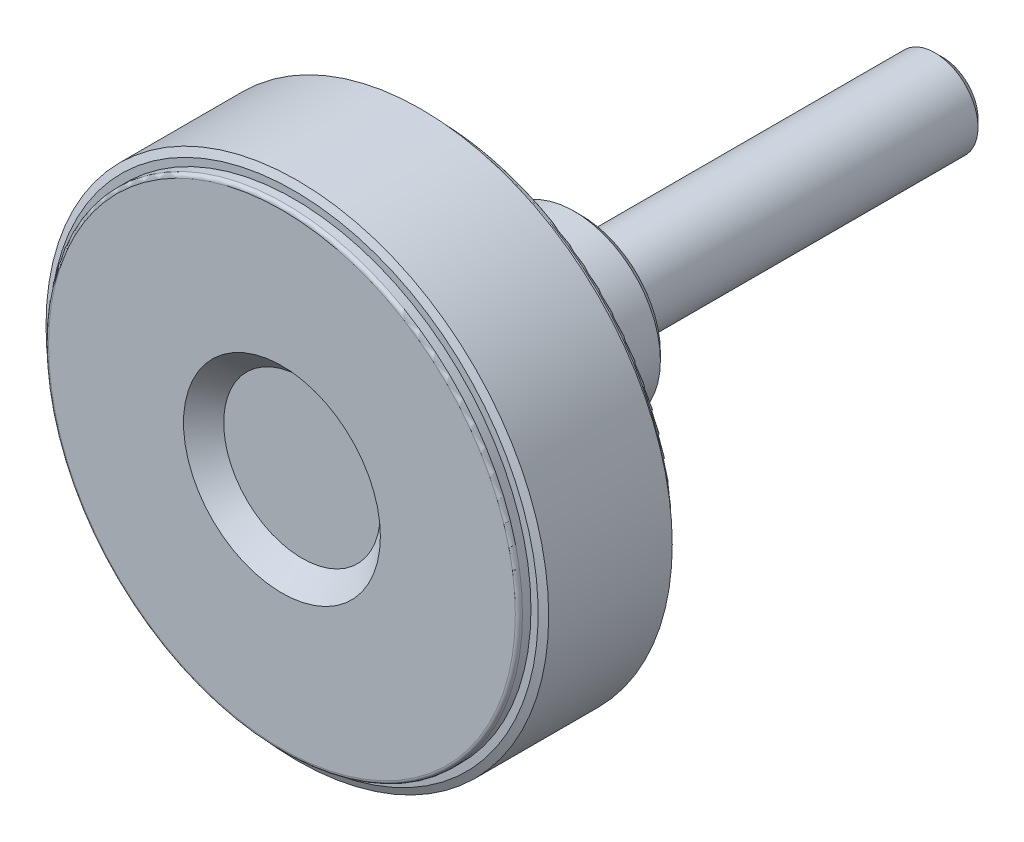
ISO-10303-21;
HEADER;
FILE_DESCRIPTION(('STEP AP214'),'2;1');
FILE_NAME('part.step','',(''),(''),'','','');
FILE_SCHEMA(('AUTOMOTIVE_DESIGN { 1 0 10303 214 1 1 1 1 }'));
ENDSEC;
DATA;
#1=APPLICATION_CONTEXT('core data for automotive mechanical design processes');
#2=APPLICATION_PROTOCOL_DEFINITION('international standard','automotive_design',2000,#1);
#3=PRODUCT_CONTEXT('',#1,'mechanical');
#4=PRODUCT('Part','Part','',(#3));
#5=PRODUCT_RELATED_PRODUCT_CATEGORY('part','',(#4));
#6=PRODUCT_DEFINITION_FORMATION('','',#4);
#7=PRODUCT_DEFINITION_CONTEXT('part definition',#1,'design');
#8=PRODUCT_DEFINITION('design','',#6,#7);
#9=PRODUCT_DEFINITION_SHAPE('','',#8);
#10=(LENGTH_UNIT() NAMED_UNIT(*) SI_UNIT(.MILLI.,.METRE.));
#11=(NAMED_UNIT(*) PLANE_ANGLE_UNIT() SI_UNIT($,.RADIAN.));
#12=(NAMED_UNIT(*) SI_UNIT($,.STERADIAN.) SOLID_ANGLE_UNIT());
#13=UNCERTAINTY_MEASURE_WITH_UNIT(LENGTH_MEASURE(1.E-05),#10,'distance_accuracy_value','');
#14=(GEOMETRIC_REPRESENTATION_CONTEXT(3) GLOBAL_UNCERTAINTY_ASSIGNED_CONTEXT((#13)) GLOBAL_UNIT_ASSIGNED_CONTEXT((#10,
#11,#12)) REPRESENTATION_CONTEXT('',''));
#15=CARTESIAN_POINT('',(0.,0.,0.));
#16=DIRECTION('',(0.,0.,1.));
#17=DIRECTION('',(1.,0.,0.));
#18=AXIS2_PLACEMENT_3D('',#15,#16,#17);
#19=CARTESIAN_POINT('',(0.,2.46325,-50.));
#20=DIRECTION('',(0.,0.,-1.));
#21=DIRECTION('',(-1.,0.,0.));
#22=AXIS2_PLACEMENT_3D('',#19,#20,#21);
#23=PLANE('',#22);
#24=CARTESIAN_POINT('',(0.,0.,-49.9999999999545));
#25=DIRECTION('',(0.,0.,1.));
#26=DIRECTION('',(1.,0.,0.));
#27=AXIS2_PLACEMENT_3D('',#24,#25,#26);
#28=CIRCLE('',#27,4.92649999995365);
#29=CARTESIAN_POINT('',(4.92649999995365,0.,-49.9999999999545));
#30=VERTEX_POINT('',#29);
#31=EDGE_CURVE('E179',#30,#30,#28,.T.);
#32=ORIENTED_EDGE('',*,*,#31,.F.);
#33=EDGE_LOOP('',(#32));
#34=FACE_BOUND('',#33,.T.);
#35=ADVANCED_FACE('F14',(#34),#23,.T.);
#36=CARTESIAN_POINT('',(0.,0.,-48.9264999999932));
#37=DIRECTION('',(0.,0.,1.));
#38=DIRECTION('',(1.,0.,0.));
#39=AXIS2_PLACEMENT_3D('',#36,#37,#38);
#40=CONICAL_SURFACE('',#39,5.99999999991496,0.785398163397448);
#41=ORIENTED_EDGE('',*,*,#31,.T.);
#42=EDGE_LOOP('',(#41));
#43=FACE_BOUND('',#42,.T.);
#44=CARTESIAN_POINT('',(0.,0.,-48.9265));
#45=DIRECTION('',(0.,0.,1.));
#46=DIRECTION('',(1.,0.,0.));
#47=AXIS2_PLACEMENT_3D('',#44,#45,#46);
#48=CIRCLE('',#47,6.);
#49=CARTESIAN_POINT('',(6.,0.,-48.9265));
#50=VERTEX_POINT('',#49);
#51=EDGE_CURVE('E176',#50,#50,#48,.T.);
#52=ORIENTED_EDGE('',*,*,#51,.F.);
#53=EDGE_LOOP('',(#52));
#54=FACE_BOUND('',#53,.T.);
#55=ADVANCED_FACE('F536',(#43,#54),#40,.T.);
#56=CARTESIAN_POINT('',(0.,0.,-23.96325));
#57=DIRECTION('',(0.,0.,1.));
#58=DIRECTION('',(1.,0.,0.));
#59=AXIS2_PLACEMENT_3D('',#56,#57,#58);
#60=CYLINDRICAL_SURFACE('',#59,6.);
#61=ORIENTED_EDGE('',*,*,#51,.T.);
#62=EDGE_LOOP('',(#61));
#63=FACE_BOUND('',#62,.T.);
#64=CARTESIAN_POINT('',(0.,0.,0.));
#65=DIRECTION('',(0.,0.,1.));
#66=DIRECTION('',(1.,0.,0.));
#67=AXIS2_PLACEMENT_3D('',#64,#65,#66);
#68=CIRCLE('',#67,6.);
#69=CARTESIAN_POINT('',(6.,0.,0.));
#70=VERTEX_POINT('',#69);
#71=EDGE_CURVE('E178',#70,#70,#68,.T.);
#72=ORIENTED_EDGE('',*,*,#71,.F.);
#73=EDGE_LOOP('',(#72));
#74=FACE_BOUND('',#73,.T.);
#75=ADVANCED_FACE('F526',(#63,#74),#60,.T.);
#76=CARTESIAN_POINT('',(0.,4.,0.));
#77=DIRECTION('',(0.,0.,-1.));
#78=DIRECTION('',(-1.,0.,0.));
#79=AXIS2_PLACEMENT_3D('',#76,#77,#78);
#80=PLANE('',#79);
#81=CARTESIAN_POINT('',(0.,0.,0.));
#82=DIRECTION('',(0.,0.,1.));
#83=DIRECTION('',(1.,0.,0.));
#84=AXIS2_PLACEMENT_3D('',#81,#82,#83);
#85=CIRCLE('',#84,8.);
#86=CARTESIAN_POINT('',(8.,0.,0.));
#87=VERTEX_POINT('',#86);
#88=EDGE_CURVE('E211',#87,#87,#85,.T.);
#89=ORIENTED_EDGE('',*,*,#88,.F.);
#90=EDGE_LOOP('',(#89));
#91=FACE_BOUND('',#90,.T.);
#92=ORIENTED_EDGE('',*,*,#71,.T.);
#93=EDGE_LOOP('',(#92));
#94=FACE_BOUND('',#93,.T.);
#95=ADVANCED_FACE('F516',(#91,#94),#80,.T.);
#96=CARTESIAN_POINT('',(0.,0.,0.15));
#97=DIRECTION('',(0.,0.,1.));
#98=DIRECTION('',(1.,0.,0.));
#99=AXIS2_PLACEMENT_3D('',#96,#97,#98);
#100=CYLINDRICAL_SURFACE('',#99,8.);
#101=ORIENTED_EDGE('',*,*,#88,.T.);
#102=EDGE_LOOP('',(#101));
#103=FACE_BOUND('',#102,.T.);
#104=CARTESIAN_POINT('',(0.,0.,0.3));
#105=DIRECTION('',(0.,0.,1.));
#106=DIRECTION('',(1.,0.,0.));
#107=AXIS2_PLACEMENT_3D('',#104,#105,#106);
#108=CIRCLE('',#107,8.);
#109=CARTESIAN_POINT('',(8.,0.,0.3));
#110=VERTEX_POINT('',#109);
#111=EDGE_CURVE('E208',#110,#110,#108,.T.);
#112=ORIENTED_EDGE('',*,*,#111,.F.);
#113=EDGE_LOOP('',(#112));
#114=FACE_BOUND('',#113,.T.);
#115=ADVANCED_FACE('F506',(#103,#114),#100,.T.);
#116=CARTESIAN_POINT('',(0.,9.5,0.3));
#117=DIRECTION('',(0.,0.,-1.));
#118=DIRECTION('',(-1.,0.,0.));
#119=AXIS2_PLACEMENT_3D('',#116,#117,#118);
#120=PLANE('',#119);
#121=CARTESIAN_POINT('',(0.,0.,0.3));
#122=DIRECTION('',(0.,0.,1.));
#123=DIRECTION('',(1.,0.,0.));
#124=AXIS2_PLACEMENT_3D('',#121,#122,#123);
#125=CIRCLE('',#124,11.);
#126=CARTESIAN_POINT('',(11.,0.,0.3));
#127=VERTEX_POINT('',#126);
#128=EDGE_CURVE('E175',#127,#127,#125,.T.);
#129=ORIENTED_EDGE('',*,*,#128,.F.);
#130=EDGE_LOOP('',(#129));
#131=FACE_BOUND('',#130,.T.);
#132=ORIENTED_EDGE('',*,*,#111,.T.);
#133=EDGE_LOOP('',(#132));
#134=FACE_BOUND('',#133,.T.);
#135=ADVANCED_FACE('F496',(#131,#134),#120,.T.);
#136=CARTESIAN_POINT('',(0.,0.,1.3));
#137=DIRECTION('',(0.,0.,1.));
#138=DIRECTION('',(1.,0.,0.));
#139=AXIS2_PLACEMENT_3D('',#136,#137,#138);
#140=CONICAL_SURFACE('',#139,12.,0.785398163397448);
#141=ORIENTED_EDGE('',*,*,#128,.T.);
#142=EDGE_LOOP('',(#141));
#143=FACE_BOUND('',#142,.T.);
#144=CARTESIAN_POINT('',(0.,0.,1.3));
#145=DIRECTION('',(0.,0.,1.));
#146=DIRECTION('',(1.,0.,0.));
#147=AXIS2_PLACEMENT_3D('',#144,#145,#146);
#148=CIRCLE('',#147,12.);
#149=CARTESIAN_POINT('',(12.,0.,1.3));
#150=VERTEX_POINT('',#149);
#151=EDGE_CURVE('E172',#150,#150,#148,.T.);
#152=ORIENTED_EDGE('',*,*,#151,.F.);
#153=EDGE_LOOP('',(#152));
#154=FACE_BOUND('',#153,.T.);
#155=ADVANCED_FACE('F487',(#143,#154),#140,.T.);
#156=CARTESIAN_POINT('',(0.,0.,17.65));
#157=DIRECTION('',(0.,0.,1.));
#158=DIRECTION('',(1.,0.,0.));
#159=AXIS2_PLACEMENT_3D('',#156,#157,#158);
#160=CYLINDRICAL_SURFACE('',#159,12.);
#161=ORIENTED_EDGE('',*,*,#151,.T.);
#162=EDGE_LOOP('',(#161));
#163=FACE_BOUND('',#162,.T.);
#164=CARTESIAN_POINT('',(0.,0.,34.));
#165=DIRECTION('',(0.,0.,-1.));
#166=DIRECTION('',(-1.,0.,0.));
#167=AXIS2_PLACEMENT_3D('',#164,#165,#166);
#168=CIRCLE('',#167,12.);
#169=CARTESIAN_POINT('',(-12.,0.,34.));
#170=VERTEX_POINT('',#169);
#171=EDGE_CURVE('E75',#170,#170,#168,.T.);
#172=ORIENTED_EDGE('',*,*,#171,.T.);
#173=EDGE_LOOP('',(#172));
#174=FACE_BOUND('',#173,.T.);
#175=ADVANCED_FACE('F482',(#163,#174),#160,.T.);
#176=CARTESIAN_POINT('',(0.,0.,34.));
#177=DIRECTION('',(0.,0.,-1.));
#178=DIRECTION('',(-1.,0.,0.));
#179=AXIS2_PLACEMENT_3D('',#176,#177,#178);
#180=TOROIDAL_SURFACE('',#179,13.,1.);
#181=CARTESIAN_POINT('',(0.,0.,35.));
#182=DIRECTION('',(0.,0.,-1.));
#183=DIRECTION('',(1.,0.,0.));
#184=AXIS2_PLACEMENT_3D('',#181,#182,#183);
#185=CIRCLE('',#184,13.);
#186=CARTESIAN_POINT('',(-13.,0.,35.));
#187=VERTEX_POINT('',#186);
#188=CARTESIAN_POINT('',(13.,0.,35.));
#189=VERTEX_POINT('',#188);
#190=EDGE_CURVE('E68',#187,#189,#185,.F.);
#191=ORIENTED_EDGE('',*,*,#190,.F.);
#192=CARTESIAN_POINT('',(0.,0.,35.));
#193=DIRECTION('',(0.,0.,-1.));
#194=DIRECTION('',(-1.,0.,0.));
#195=AXIS2_PLACEMENT_3D('',#192,#193,#194);
#196=CIRCLE('',#195,13.);
#197=CARTESIAN_POINT('',(0.,13.,35.));
#198=VERTEX_POINT('',#197);
#199=EDGE_CURVE('E71',#198,#187,#196,.F.);
#200=ORIENTED_EDGE('',*,*,#199,.F.);
#201=CARTESIAN_POINT('',(0.,0.,35.));
#202=DIRECTION('',(0.,0.,-1.));
#203=DIRECTION('',(0.,1.,0.));
#204=AXIS2_PLACEMENT_3D('',#201,#202,#203);
#205=CIRCLE('',#204,13.);
#206=EDGE_CURVE('E63',#189,#198,#205,.F.);
#207=ORIENTED_EDGE('',*,*,#206,.F.);
#208=EDGE_LOOP('',(#191,#200,#207));
#209=FACE_BOUND('',#208,.T.);
#210=ORIENTED_EDGE('',*,*,#171,.F.);
#211=EDGE_LOOP('',(#210));
#212=FACE_BOUND('',#211,.T.);
#213=ADVANCED_FACE('F66',(#209,#212),#180,.F.);
#214=CARTESIAN_POINT('',(0.,19.4615384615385,35.));
#215=DIRECTION('',(0.,0.,-1.));
#216=DIRECTION('',(-1.,0.,0.));
#217=AXIS2_PLACEMENT_3D('',#214,#215,#216);
#218=PLANE('',#217);
#219=CARTESIAN_POINT('',(0.,0.,35.));
#220=DIRECTION('',(0.,0.,1.));
#221=DIRECTION('',(-1.,0.,0.));
#222=AXIS2_PLACEMENT_3D('',#219,#220,#221);
#223=CIRCLE('',#222,25.9230769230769);
#224=CARTESIAN_POINT('',(25.9230769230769,0.,35.));
#225=VERTEX_POINT('',#224);
#226=CARTESIAN_POINT('',(-25.9230769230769,0.,35.));
#227=VERTEX_POINT('',#226);
#228=EDGE_CURVE('E81',#225,#227,#223,.F.);
#229=ORIENTED_EDGE('',*,*,#228,.T.);
#230=CARTESIAN_POINT('',(0.,0.,35.));
#231=DIRECTION('',(0.,0.,1.));
#232=DIRECTION('',(0.,1.,0.));
#233=AXIS2_PLACEMENT_3D('',#230,#231,#232);
#234=CIRCLE('',#233,25.9230769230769);
#235=CARTESIAN_POINT('',(0.,25.9230769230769,35.));
#236=VERTEX_POINT('',#235);
#237=EDGE_CURVE('E130',#227,#236,#234,.F.);
#238=ORIENTED_EDGE('',*,*,#237,.T.);
#239=CARTESIAN_POINT('',(0.,0.,35.));
#240=DIRECTION('',(0.,0.,1.));
#241=DIRECTION('',(1.,0.,0.));
#242=AXIS2_PLACEMENT_3D('',#239,#240,#241);
#243=CIRCLE('',#242,25.9230769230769);
#244=EDGE_CURVE('E143',#236,#225,#243,.F.);
#245=ORIENTED_EDGE('',*,*,#244,.T.);
#246=EDGE_LOOP('',(#229,#238,#245));
#247=FACE_BOUND('',#246,.T.);
#248=ORIENTED_EDGE('',*,*,#199,.T.);
#249=ORIENTED_EDGE('',*,*,#190,.T.);
#250=ORIENTED_EDGE('',*,*,#206,.T.);
#251=EDGE_LOOP('',(#248,#249,#250));
#252=FACE_BOUND('',#251,.T.);
#253=ADVANCED_FACE('F79',(#247,#252),#218,.T.);
#254=CARTESIAN_POINT('',(0.,0.,34.));
#255=DIRECTION('',(0.,0.,-1.));
#256=DIRECTION('',(-1.,0.,0.));
#257=AXIS2_PLACEMENT_3D('',#254,#255,#256);
#258=TOROIDAL_SURFACE('',#257,25.9230769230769,1.);
#259=ORIENTED_EDGE('',*,*,#237,.F.);
#260=ORIENTED_EDGE('',*,*,#228,.F.);
#261=ORIENTED_EDGE('',*,*,#244,.F.);
#262=EDGE_LOOP('',(#259,#260,#261));
#263=FACE_BOUND('',#262,.T.);
#264=CARTESIAN_POINT('',(0.,0.,34.));
#265=DIRECTION('',(0.,0.,1.));
#266=DIRECTION('',(1.,0.,0.));
#267=AXIS2_PLACEMENT_3D('',#264,#265,#266);
#268=CIRCLE('',#267,26.9230769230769);
#269=CARTESIAN_POINT('',(26.9230769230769,0.,34.));
#270=VERTEX_POINT('',#269);
#271=EDGE_CURVE('E205',#270,#270,#268,.F.);
#272=ORIENTED_EDGE('',*,*,#271,.T.);
#273=EDGE_LOOP('',(#272));
#274=FACE_BOUND('',#273,.T.);
#275=ADVANCED_FACE('F100',(#263,#274),#258,.F.);
#276=CARTESIAN_POINT('',(0.,0.,27.25));
#277=DIRECTION('',(0.,0.,1.));
#278=DIRECTION('',(1.,0.,0.));
#279=AXIS2_PLACEMENT_3D('',#276,#277,#278);
#280=CYLINDRICAL_SURFACE('',#279,26.9230769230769);
#281=ORIENTED_EDGE('',*,*,#271,.F.);
#282=EDGE_LOOP('',(#281));
#283=FACE_BOUND('',#282,.T.);
#284=CARTESIAN_POINT('',(0.,0.,20.5));
#285=DIRECTION('',(0.,0.,1.));
#286=DIRECTION('',(1.,0.,0.));
#287=AXIS2_PLACEMENT_3D('',#284,#285,#286);
#288=CIRCLE('',#287,26.9230769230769);
#289=CARTESIAN_POINT('',(26.9230769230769,0.,20.5));
#290=VERTEX_POINT('',#289);
#291=EDGE_CURVE('E201',#290,#290,#288,.T.);
#292=ORIENTED_EDGE('',*,*,#291,.F.);
#293=EDGE_LOOP('',(#292));
#294=FACE_BOUND('',#293,.T.);
#295=ADVANCED_FACE('F329',(#283,#294),#280,.F.);
#296=CARTESIAN_POINT('',(0.,29.7115384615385,20.5));
#297=DIRECTION('',(0.,0.,-1.));
#298=DIRECTION('',(-1.,0.,0.));
#299=AXIS2_PLACEMENT_3D('',#296,#297,#298);
#300=PLANE('',#299);
#301=CARTESIAN_POINT('',(0.,0.,20.5));
#302=DIRECTION('',(0.,0.,1.));
#303=DIRECTION('',(-1.,0.,0.));
#304=AXIS2_PLACEMENT_3D('',#301,#302,#303);
#305=CIRCLE('',#304,32.5);
#306=CARTESIAN_POINT('',(-32.5,0.,20.5));
#307=VERTEX_POINT('',#306);
#308=CARTESIAN_POINT('',(32.5,0.,20.5));
#309=VERTEX_POINT('',#308);
#310=EDGE_CURVE('E264',#307,#309,#305,.T.);
#311=ORIENTED_EDGE('',*,*,#310,.F.);
#312=CARTESIAN_POINT('',(0.,0.,20.5));
#313=DIRECTION('',(0.,0.,1.));
#314=DIRECTION('',(0.,1.,0.));
#315=AXIS2_PLACEMENT_3D('',#312,#313,#314);
#316=CIRCLE('',#315,32.5);
#317=CARTESIAN_POINT('',(0.,32.5,20.5));
#318=VERTEX_POINT('',#317);
#319=EDGE_CURVE('E299',#318,#307,#316,.T.);
#320=ORIENTED_EDGE('',*,*,#319,.F.);
#321=CARTESIAN_POINT('',(0.,0.,20.5));
#322=DIRECTION('',(0.,0.,1.));
#323=DIRECTION('',(1.,0.,0.));
#324=AXIS2_PLACEMENT_3D('',#321,#322,#323);
#325=CIRCLE('',#324,32.5);
#326=EDGE_CURVE('E204',#309,#318,#325,.T.);
#327=ORIENTED_EDGE('',*,*,#326,.F.);
#328=EDGE_LOOP('',(#311,#320,#327));
#329=FACE_BOUND('',#328,.T.);
#330=ORIENTED_EDGE('',*,*,#291,.T.);
#331=EDGE_LOOP('',(#330));
#332=FACE_BOUND('',#331,.T.);
#333=ADVANCED_FACE('F275',(#329,#332),#300,.T.);
#334=CARTESIAN_POINT('',(0.,0.,21.));
#335=DIRECTION('',(0.,0.,-1.));
#336=DIRECTION('',(-1.,0.,0.));
#337=AXIS2_PLACEMENT_3D('',#334,#335,#336);
#338=TOROIDAL_SURFACE('',#337,32.5,0.5);
#339=ORIENTED_EDGE('',*,*,#319,.T.);
#340=ORIENTED_EDGE('',*,*,#310,.T.);
#341=ORIENTED_EDGE('',*,*,#326,.T.);
#342=EDGE_LOOP('',(#339,#340,#341));
#343=FACE_BOUND('',#342,.T.);
#344=CARTESIAN_POINT('',(0.,0.,21.));
#345=DIRECTION('',(0.,0.,1.));
#346=DIRECTION('',(1.,0.,0.));
#347=AXIS2_PLACEMENT_3D('',#344,#345,#346);
#348=CIRCLE('',#347,33.);
#349=CARTESIAN_POINT('',(33.,0.,21.));
#350=VERTEX_POINT('',#349);
#351=EDGE_CURVE('E200',#350,#350,#348,.T.);
#352=ORIENTED_EDGE('',*,*,#351,.F.);
#353=EDGE_LOOP('',(#352));
#354=FACE_BOUND('',#353,.T.);
#355=ADVANCED_FACE('F269',(#343,#354),#338,.T.);
#356=CARTESIAN_POINT('',(0.,0.,21.59));
#357=DIRECTION('',(0.,0.,1.));
#358=DIRECTION('',(1.,0.,0.));
#359=AXIS2_PLACEMENT_3D('',#356,#357,#358);
#360=CYLINDRICAL_SURFACE('',#359,33.);
#361=ORIENTED_EDGE('',*,*,#351,.T.);
#362=EDGE_LOOP('',(#361));
#363=FACE_BOUND('',#362,.T.);
#364=CARTESIAN_POINT('',(0.,0.,22.18));
#365=DIRECTION('',(0.,0.,1.));
#366=DIRECTION('',(1.,0.,0.));
#367=AXIS2_PLACEMENT_3D('',#364,#365,#366);
#368=CIRCLE('',#367,33.);
#369=CARTESIAN_POINT('',(33.,0.,22.18));
#370=VERTEX_POINT('',#369);
#371=EDGE_CURVE('E197',#370,#370,#368,.T.);
#372=ORIENTED_EDGE('',*,*,#371,.F.);
#373=EDGE_LOOP('',(#372));
#374=FACE_BOUND('',#373,.T.);
#375=ADVANCED_FACE('F274',(#363,#374),#360,.T.);
#376=CARTESIAN_POINT('',(0.,33.5,22.18));
#377=DIRECTION('',(0.,0.,-1.));
#378=DIRECTION('',(-1.,0.,0.));
#379=AXIS2_PLACEMENT_3D('',#376,#377,#378);
#380=PLANE('',#379);
#381=CARTESIAN_POINT('',(0.,0.,22.18));
#382=DIRECTION('',(0.,0.,1.));
#383=DIRECTION('',(1.,0.,0.));
#384=AXIS2_PLACEMENT_3D('',#381,#382,#383);
#385=CIRCLE('',#384,34.);
#386=CARTESIAN_POINT('',(34.,0.,22.18));
#387=VERTEX_POINT('',#386);
#388=EDGE_CURVE('E193',#387,#387,#385,.T.);
#389=ORIENTED_EDGE('',*,*,#388,.F.);
#390=EDGE_LOOP('',(#389));
#391=FACE_BOUND('',#390,.T.);
#392=ORIENTED_EDGE('',*,*,#371,.T.);
#393=EDGE_LOOP('',(#392));
#394=FACE_BOUND('',#393,.T.);
#395=ADVANCED_FACE('F342',(#391,#394),#380,.T.);
#396=CARTESIAN_POINT('',(0.,0.,22.646307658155));
#397=DIRECTION('',(0.,0.,1.));
#398=DIRECTION('',(1.,0.,0.));
#399=AXIS2_PLACEMENT_3D('',#396,#397,#398);
#400=CONICAL_SURFACE('',#399,35.,1.13446401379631);
#401=CARTESIAN_POINT('',(0.,2.67164068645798E-12,22.646307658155));
#402=DIRECTION('',(0.,0.,-1.));
#403=DIRECTION('',(-1.,0.,0.));
#404=AXIS2_PLACEMENT_3D('',#401,#402,#403);
#405=CIRCLE('',#404,34.9999999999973);
#406=CARTESIAN_POINT('',(-34.9999999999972,2.67164068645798E-12,22.646307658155));
#407=VERTEX_POINT('',#406);
#408=EDGE_CURVE('E196',#407,#407,#405,.F.);
#409=ORIENTED_EDGE('',*,*,#408,.F.);
#410=EDGE_LOOP('',(#409));
#411=FACE_BOUND('',#410,.T.);
#412=ORIENTED_EDGE('',*,*,#388,.T.);
#413=EDGE_LOOP('',(#412));
#414=FACE_BOUND('',#413,.T.);
#415=ADVANCED_FACE('F340',(#411,#414),#400,.T.);
#416=CARTESIAN_POINT('',(0.,5.45454545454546,39.2));
#417=DIRECTION('',(0.,0.,1.));
#418=DIRECTION('',(1.,0.,0.));
#419=AXIS2_PLACEMENT_3D('',#416,#417,#418);
#420=PLANE('',#419);
#421=CARTESIAN_POINT('',(0.,0.,39.2));
#422=DIRECTION('',(0.,0.,1.));
#423=DIRECTION('',(1.,0.,0.));
#424=AXIS2_PLACEMENT_3D('',#421,#422,#423);
#425=CIRCLE('',#424,10.9090909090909);
#426=CARTESIAN_POINT('',(10.9090909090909,0.,39.2));
#427=VERTEX_POINT('',#426);
#428=EDGE_CURVE('E181',#427,#427,#425,.T.);
#429=ORIENTED_EDGE('',*,*,#428,.T.);
#430=EDGE_LOOP('',(#429));
#431=FACE_BOUND('',#430,.T.);
#432=ADVANCED_FACE('F242',(#431),#420,.T.);
#433=CARTESIAN_POINT('',(0.,0.,42.));
#434=DIRECTION('',(0.,0.,1.));
#435=DIRECTION('',(1.,0.,0.));
#436=AXIS2_PLACEMENT_3D('',#433,#434,#435);
#437=CONICAL_SURFACE('',#436,13.7090909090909,0.785398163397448);
#438=CARTESIAN_POINT('',(0.,0.,42.));
#439=DIRECTION('',(0.,0.,1.));
#440=DIRECTION('',(1.,0.,0.));
#441=AXIS2_PLACEMENT_3D('',#438,#439,#440);
#442=CIRCLE('',#441,13.7090909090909);
#443=CARTESIAN_POINT('',(13.7090909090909,0.,42.));
#444=VERTEX_POINT('',#443);
#445=EDGE_CURVE('E9',#444,#444,#442,.F.);
#446=ORIENTED_EDGE('',*,*,#445,.F.);
#447=EDGE_LOOP('',(#446));
#448=FACE_BOUND('',#447,.T.);
#449=ORIENTED_EDGE('',*,*,#428,.F.);
#450=EDGE_LOOP('',(#449));
#451=FACE_BOUND('',#450,.T.);
#452=ADVANCED_FACE('F240',(#448,#451),#437,.F.);
#453=CARTESIAN_POINT('',(0.,23.1045454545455,42.));
#454=DIRECTION('',(0.,0.,1.));
#455=DIRECTION('',(1.,0.,0.));
#456=AXIS2_PLACEMENT_3D('',#453,#454,#455);
#457=PLANE('',#456);
#458=ORIENTED_EDGE('',*,*,#445,.T.);
#459=EDGE_LOOP('',(#458));
#460=FACE_BOUND('',#459,.T.);
#461=CARTESIAN_POINT('',(0.,0.,42.));
#462=DIRECTION('',(0.,0.,-1.));
#463=DIRECTION('',(-1.,0.,0.));
#464=AXIS2_PLACEMENT_3D('',#461,#462,#463);
#465=CIRCLE('',#464,32.5);
#466=CARTESIAN_POINT('',(0.,32.5,42.));
#467=VERTEX_POINT('',#466);
#468=CARTESIAN_POINT('',(-32.5,0.,42.));
#469=VERTEX_POINT('',#468);
#470=EDGE_CURVE('E219',#467,#469,#465,.F.);
#471=ORIENTED_EDGE('',*,*,#470,.T.);
#472=CARTESIAN_POINT('',(0.,0.,42.));
#473=DIRECTION('',(0.,0.,-1.));
#474=DIRECTION('',(1.,0.,0.));
#475=AXIS2_PLACEMENT_3D('',#472,#473,#474);
#476=CIRCLE('',#475,32.5);
#477=CARTESIAN_POINT('',(32.5,0.,42.));
#478=VERTEX_POINT('',#477);
#479=EDGE_CURVE('E23',#469,#478,#476,.F.);
#480=ORIENTED_EDGE('',*,*,#479,.T.);
#481=CARTESIAN_POINT('',(0.,0.,42.));
#482=DIRECTION('',(0.,0.,-1.));
#483=DIRECTION('',(0.,1.,0.));
#484=AXIS2_PLACEMENT_3D('',#481,#482,#483);
#485=CIRCLE('',#484,32.5);
#486=EDGE_CURVE('E184',#478,#467,#485,.F.);
#487=ORIENTED_EDGE('',*,*,#486,.T.);
#488=EDGE_LOOP('',(#471,#480,#487));
#489=FACE_BOUND('',#488,.T.);
#490=ADVANCED_FACE('F238',(#460,#489),#457,.T.);
#491=CARTESIAN_POINT('',(0.,0.,41.5));
#492=DIRECTION('',(0.,0.,-1.));
#493=DIRECTION('',(-1.,0.,0.));
#494=AXIS2_PLACEMENT_3D('',#491,#492,#493);
#495=TOROIDAL_SURFACE('',#494,32.5,0.499999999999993);
#496=CARTESIAN_POINT('',(0.,0.,41.5));
#497=DIRECTION('',(0.,0.,-1.));
#498=DIRECTION('',(-1.,0.,0.));
#499=AXIS2_PLACEMENT_3D('',#496,#497,#498);
#500=CIRCLE('',#499,33.);
#501=CARTESIAN_POINT('',(-33.,0.,41.5));
#502=VERTEX_POINT('',#501);
#503=EDGE_CURVE('E185',#502,#502,#500,.F.);
#504=ORIENTED_EDGE('',*,*,#503,.T.);
#505=EDGE_LOOP('',(#504));
#506=FACE_BOUND('',#505,.T.);
#507=ORIENTED_EDGE('',*,*,#479,.F.);
#508=ORIENTED_EDGE('',*,*,#470,.F.);
#509=ORIENTED_EDGE('',*,*,#486,.F.);
#510=EDGE_LOOP('',(#507,#508,#509));
#511=FACE_BOUND('',#510,.T.);
#512=ADVANCED_FACE('F226',(#506,#511),#495,.T.);
#513=CARTESIAN_POINT('',(0.,0.,40.91));
#514=DIRECTION('',(0.,0.,1.));
#515=DIRECTION('',(1.,0.,0.));
#516=AXIS2_PLACEMENT_3D('',#513,#514,#515);
#517=CYLINDRICAL_SURFACE('',#516,33.);
#518=ORIENTED_EDGE('',*,*,#503,.F.);
#519=EDGE_LOOP('',(#518));
#520=FACE_BOUND('',#519,.T.);
#521=CARTESIAN_POINT('',(0.,0.,40.32));
#522=DIRECTION('',(0.,0.,1.));
#523=DIRECTION('',(1.,0.,0.));
#524=AXIS2_PLACEMENT_3D('',#521,#522,#523);
#525=CIRCLE('',#524,33.);
#526=CARTESIAN_POINT('',(33.,0.,40.32));
#527=VERTEX_POINT('',#526);
#528=EDGE_CURVE('E186',#527,#527,#525,.T.);
#529=ORIENTED_EDGE('',*,*,#528,.T.);
#530=EDGE_LOOP('',(#529));
#531=FACE_BOUND('',#530,.T.);
#532=ADVANCED_FACE('F237',(#520,#531),#517,.T.);
#533=CARTESIAN_POINT('',(0.,0.,39.853692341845));
#534=DIRECTION('',(0.,0.,-1.));
#535=DIRECTION('',(-1.,0.,0.));
#536=AXIS2_PLACEMENT_3D('',#533,#534,#535);
#537=CONICAL_SURFACE('',#536,35.,1.13446401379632);
#538=CARTESIAN_POINT('',(0.,0.,40.32));
#539=DIRECTION('',(0.,0.,-1.));
#540=DIRECTION('',(-1.,0.,0.));
#541=AXIS2_PLACEMENT_3D('',#538,#539,#540);
#542=CIRCLE('',#541,34.);
#543=CARTESIAN_POINT('',(-34.,0.,40.32));
#544=VERTEX_POINT('',#543);
#545=EDGE_CURVE('E189',#544,#544,#542,.F.);
#546=ORIENTED_EDGE('',*,*,#545,.F.);
#547=EDGE_LOOP('',(#546));
#548=FACE_BOUND('',#547,.T.);
#549=CARTESIAN_POINT('',(0.,0.,39.853692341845));
#550=DIRECTION('',(0.,0.,-1.));
#551=DIRECTION('',(0.,1.,0.));
#552=AXIS2_PLACEMENT_3D('',#549,#550,#551);
#553=CIRCLE('',#552,35.);
#554=CARTESIAN_POINT('',(0.,35.,39.853692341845));
#555=VERTEX_POINT('',#554);
#556=EDGE_CURVE('E192',#555,#555,#553,.F.);
#557=ORIENTED_EDGE('',*,*,#556,.T.);
#558=EDGE_LOOP('',(#557));
#559=FACE_BOUND('',#558,.T.);
#560=ADVANCED_FACE('F360',(#548,#559),#537,.T.);
#561=CARTESIAN_POINT('',(0.,33.5,40.32));
#562=DIRECTION('',(0.,0.,1.));
#563=DIRECTION('',(1.,0.,0.));
#564=AXIS2_PLACEMENT_3D('',#561,#562,#563);
#565=PLANE('',#564);
#566=ORIENTED_EDGE('',*,*,#528,.F.);
#567=EDGE_LOOP('',(#566));
#568=FACE_BOUND('',#567,.T.);
#569=ORIENTED_EDGE('',*,*,#545,.T.);
#570=EDGE_LOOP('',(#569));
#571=FACE_BOUND('',#570,.T.);
#572=ADVANCED_FACE('F358',(#568,#571),#565,.T.);
#573=CARTESIAN_POINT('',(0.,2.67164068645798E-12,0.));
#574=DIRECTION('',(0.,0.,-1.));
#575=DIRECTION('',(-1.,0.,0.));
#576=AXIS2_PLACEMENT_3D('',#573,#574,#575);
#577=CYLINDRICAL_SURFACE('',#576,34.9999999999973);
#578=ORIENTED_EDGE('',*,*,#408,.T.);
#579=EDGE_LOOP('',(#578));
#580=FACE_BOUND('',#579,.T.);
#581=ORIENTED_EDGE('',*,*,#556,.F.);
#582=EDGE_LOOP('',(#581));
#583=FACE_BOUND('',#582,.T.);
#584=ADVANCED_FACE('F355',(#580,#583),#577,.T.);
#585=CLOSED_SHELL('',(#35,#55,#75,#95,#115,#135,#155,#175,#213,#253,#275,#295,#333,#355,#375,
#395,#415,#432,#452,#490,#512,#532,#560,#572,#584));
#586=MANIFOLD_SOLID_BREP('B1',#585);
#587=ADVANCED_BREP_SHAPE_REPRESENTATION('',(#18,#586),#14);
#588=SHAPE_DEFINITION_REPRESENTATION(#9,#587);
ENDSEC;
END-ISO-10303-21;
